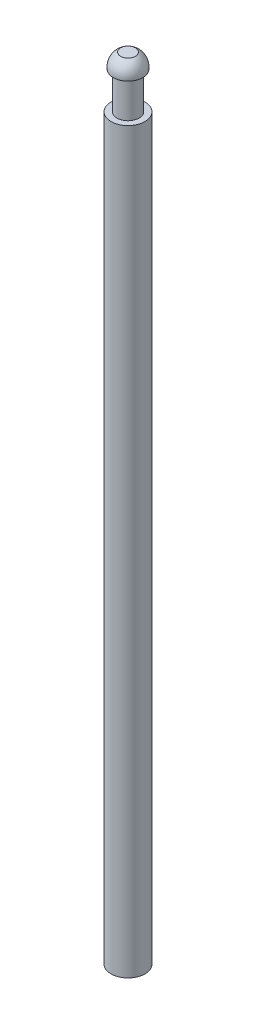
from build123d import *

# Parameters (mm, degrees)
SKETCH_4_R      = 1.15
EXTRUDE_1_DEPTH = 50


with BuildPart() as part:
    # Sketch 3 → Revolve 1 (revolve)
    with BuildSketch(Plane.XY, mode=Mode.PRIVATE) as revolve_1_sk:
        with BuildLine():
            Line((-0.75, 35.807250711), (-1, 35.807250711))
            ThreePointArc((-1, 35.807250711), (-0.901387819, 36.38294462), (-0.5, 36.807250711))
            Line((-0.5, 36.807250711), (0, 36.807250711))
            Line((0, 36.807250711), (0, 33.307250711))
            Line((0, 33.307250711), (-0.75, 33.307250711))
            Line((-0.75, 33.307250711), (-0.75, 35.807250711))
        make_face()
    revolve(revolve_1_sk.sketch.rotate(Axis((0, 0, 0), (0, 1, 0)), 270), axis=Axis((0, 0, 0), (0, 1, 0)))

    # Sketch 4 → Extrude 1 (add)
    with BuildSketch(Plane.XZ.offset(-33.307250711)):
        with Locations(Location((0, 0, 0), (0, 0, 270))):
            Circle(SKETCH_4_R)
    extrude(amount=EXTRUDE_1_DEPTH)


solid = part.part
